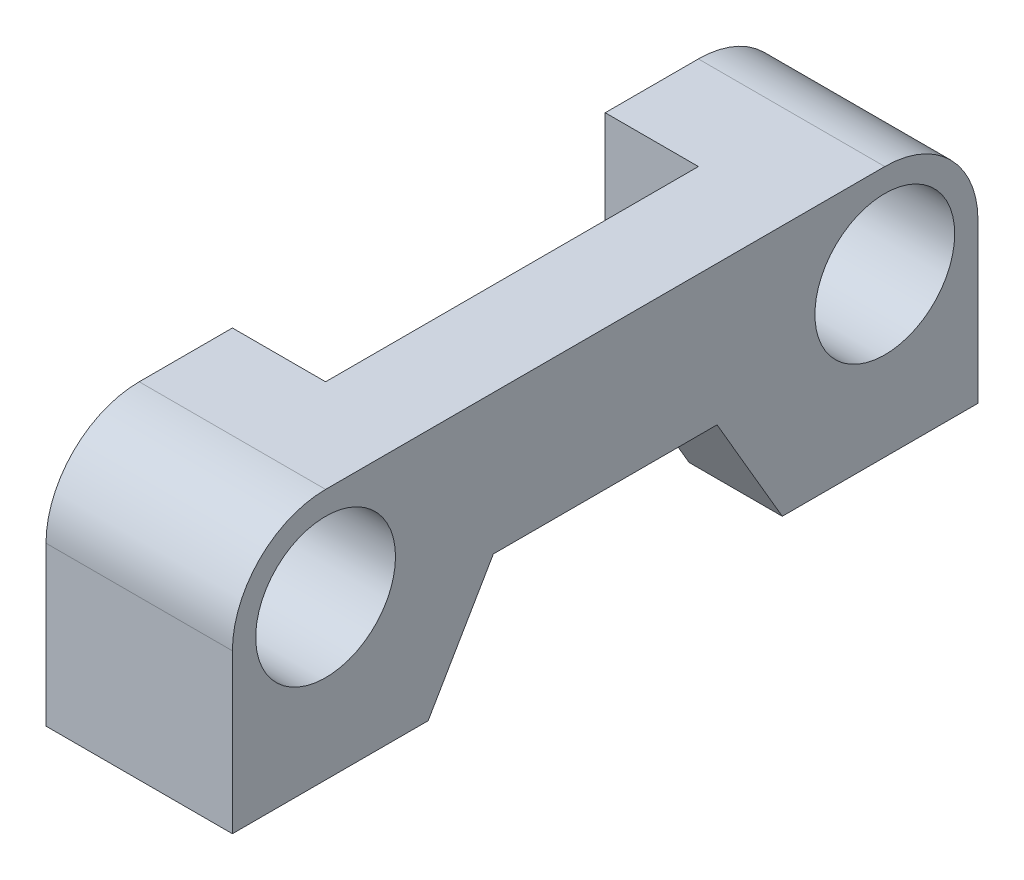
ISO-10303-21;
HEADER;
FILE_DESCRIPTION(('STEP AP214'),'2;1');
FILE_NAME('part.step','',(''),(''),'','','');
FILE_SCHEMA(('AUTOMOTIVE_DESIGN { 1 0 10303 214 1 1 1 1 }'));
ENDSEC;
DATA;
#1=APPLICATION_CONTEXT('core data for automotive mechanical design processes');
#2=APPLICATION_PROTOCOL_DEFINITION('international standard','automotive_design',2000,#1);
#3=PRODUCT_CONTEXT('',#1,'mechanical');
#4=PRODUCT('Part','Part','',(#3));
#5=PRODUCT_RELATED_PRODUCT_CATEGORY('part','',(#4));
#6=PRODUCT_DEFINITION_FORMATION('','',#4);
#7=PRODUCT_DEFINITION_CONTEXT('part definition',#1,'design');
#8=PRODUCT_DEFINITION('design','',#6,#7);
#9=PRODUCT_DEFINITION_SHAPE('','',#8);
#10=(LENGTH_UNIT() NAMED_UNIT(*) SI_UNIT(.MILLI.,.METRE.));
#11=(NAMED_UNIT(*) PLANE_ANGLE_UNIT() SI_UNIT($,.RADIAN.));
#12=(NAMED_UNIT(*) SI_UNIT($,.STERADIAN.) SOLID_ANGLE_UNIT());
#13=UNCERTAINTY_MEASURE_WITH_UNIT(LENGTH_MEASURE(1.E-05),#10,'distance_accuracy_value','');
#14=(GEOMETRIC_REPRESENTATION_CONTEXT(3) GLOBAL_UNCERTAINTY_ASSIGNED_CONTEXT((#13)) GLOBAL_UNIT_ASSIGNED_CONTEXT((#10,
#11,#12)) REPRESENTATION_CONTEXT('',''));
#15=CARTESIAN_POINT('',(0.,0.,0.));
#16=DIRECTION('',(0.,0.,1.));
#17=DIRECTION('',(1.,0.,0.));
#18=AXIS2_PLACEMENT_3D('',#15,#16,#17);
#19=CARTESIAN_POINT('',(0.,3.5,-30.));
#20=DIRECTION('',(1.,0.,0.));
#21=DIRECTION('',(0.,0.,-1.));
#22=AXIS2_PLACEMENT_3D('',#19,#20,#21);
#23=PLANE('',#22);
#24=CARTESIAN_POINT('',(0.,3.5,-30.));
#25=DIRECTION('',(1.,0.,0.));
#26=DIRECTION('',(0.,0.,-1.));
#27=AXIS2_PLACEMENT_3D('',#24,#25,#26);
#28=CIRCLE('',#27,7.5);
#29=CARTESIAN_POINT('',(0.,3.5,-37.5));
#30=VERTEX_POINT('',#29);
#31=EDGE_CURVE('E239',#30,#30,#28,.T.);
#32=ORIENTED_EDGE('',*,*,#31,.T.);
#33=EDGE_LOOP('',(#32));
#34=FACE_BOUND('',#33,.T.);
#35=DIRECTION('',(0.,0.,-1.));
#36=VECTOR('',#35,1.);
#37=CARTESIAN_POINT('',(0.,-13.5,-40.));
#38=LINE('',#37,#36);
#39=CARTESIAN_POINT('',(0.,-13.5,-20.));
#40=VERTEX_POINT('',#39);
#41=CARTESIAN_POINT('',(0.,-13.5,-40.));
#42=VERTEX_POINT('',#41);
#43=EDGE_CURVE('E91',#40,#42,#38,.T.);
#44=ORIENTED_EDGE('',*,*,#43,.F.);
#45=DIRECTION('',(0.,1.,0.));
#46=VECTOR('',#45,1.);
#47=CARTESIAN_POINT('',(0.,-13.5,-20.));
#48=LINE('',#47,#46);
#49=CARTESIAN_POINT('',(0.,13.5,-20.));
#50=VERTEX_POINT('',#49);
#51=EDGE_CURVE('E204',#40,#50,#48,.T.);
#52=ORIENTED_EDGE('',*,*,#51,.T.);
#53=DIRECTION('',(0.,0.,1.));
#54=VECTOR('',#53,1.);
#55=CARTESIAN_POINT('',(0.,13.5,-29.9999999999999));
#56=LINE('',#55,#54);
#57=CARTESIAN_POINT('',(0.,13.5,-29.9999999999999));
#58=VERTEX_POINT('',#57);
#59=EDGE_CURVE('E163',#58,#50,#56,.T.);
#60=ORIENTED_EDGE('',*,*,#59,.F.);
#61=CARTESIAN_POINT('',(0.,3.5,-30.));
#62=DIRECTION('',(1.,0.,0.));
#63=DIRECTION('',(0.,0.,-1.));
#64=AXIS2_PLACEMENT_3D('',#61,#62,#63);
#65=CIRCLE('',#64,10.);
#66=CARTESIAN_POINT('',(0.,3.49999999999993,-40.));
#67=VERTEX_POINT('',#66);
#68=EDGE_CURVE('E158',#67,#58,#65,.T.);
#69=ORIENTED_EDGE('',*,*,#68,.F.);
#70=DIRECTION('',(0.,1.,0.));
#71=VECTOR('',#70,1.);
#72=CARTESIAN_POINT('',(0.,-13.5,-40.));
#73=LINE('',#72,#71);
#74=EDGE_CURVE('E154',#42,#67,#73,.T.);
#75=ORIENTED_EDGE('',*,*,#74,.F.);
#76=EDGE_LOOP('',(#44,#52,#60,#69,#75));
#77=FACE_BOUND('',#76,.T.);
#78=ADVANCED_FACE('F40',(#34,#77),#23,.F.);
#79=CARTESIAN_POINT('',(20.,3.5,-30.));
#80=DIRECTION('',(1.,0.,0.));
#81=DIRECTION('',(0.,0.,-1.));
#82=AXIS2_PLACEMENT_3D('',#79,#80,#81);
#83=PLANE('',#82);
#84=CARTESIAN_POINT('',(20.,3.5,30.));
#85=DIRECTION('',(1.,0.,0.));
#86=DIRECTION('',(0.,0.,-1.));
#87=AXIS2_PLACEMENT_3D('',#84,#85,#86);
#88=CIRCLE('',#87,7.5);
#89=CARTESIAN_POINT('',(20.,3.5,22.5));
#90=VERTEX_POINT('',#89);
#91=EDGE_CURVE('E159',#90,#90,#88,.T.);
#92=ORIENTED_EDGE('',*,*,#91,.F.);
#93=EDGE_LOOP('',(#92));
#94=FACE_BOUND('',#93,.T.);
#95=DIRECTION('',(0.,1.,0.));
#96=VECTOR('',#95,1.);
#97=CARTESIAN_POINT('',(20.,-13.5,-40.));
#98=LINE('',#97,#96);
#99=CARTESIAN_POINT('',(20.,-13.5,-40.));
#100=VERTEX_POINT('',#99);
#101=CARTESIAN_POINT('',(20.,3.49999999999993,-40.));
#102=VERTEX_POINT('',#101);
#103=EDGE_CURVE('E174',#100,#102,#98,.T.);
#104=ORIENTED_EDGE('',*,*,#103,.T.);
#105=CARTESIAN_POINT('',(20.,3.5,-30.));
#106=DIRECTION('',(1.,0.,0.));
#107=DIRECTION('',(0.,0.,-1.));
#108=AXIS2_PLACEMENT_3D('',#105,#106,#107);
#109=CIRCLE('',#108,10.);
#110=CARTESIAN_POINT('',(20.,13.5,-29.9999999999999));
#111=VERTEX_POINT('',#110);
#112=EDGE_CURVE('E101',#102,#111,#109,.T.);
#113=ORIENTED_EDGE('',*,*,#112,.T.);
#114=DIRECTION('',(0.,0.,1.));
#115=VECTOR('',#114,1.);
#116=CARTESIAN_POINT('',(20.,13.5,-29.9999999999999));
#117=LINE('',#116,#115);
#118=CARTESIAN_POINT('',(20.,13.5,30.));
#119=VERTEX_POINT('',#118);
#120=EDGE_CURVE('E258',#111,#119,#117,.T.);
#121=ORIENTED_EDGE('',*,*,#120,.T.);
#122=CARTESIAN_POINT('',(20.,3.5,30.));
#123=DIRECTION('',(1.,0.,0.));
#124=DIRECTION('',(0.,0.,-1.));
#125=AXIS2_PLACEMENT_3D('',#122,#123,#124);
#126=CIRCLE('',#125,10.);
#127=CARTESIAN_POINT('',(20.,3.49999999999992,40.));
#128=VERTEX_POINT('',#127);
#129=EDGE_CURVE('E260',#119,#128,#126,.T.);
#130=ORIENTED_EDGE('',*,*,#129,.T.);
#131=DIRECTION('',(0.,-1.,0.));
#132=VECTOR('',#131,1.);
#133=CARTESIAN_POINT('',(20.,-13.5,40.));
#134=LINE('',#133,#132);
#135=CARTESIAN_POINT('',(20.,-13.5,40.));
#136=VERTEX_POINT('',#135);
#137=EDGE_CURVE('E262',#128,#136,#134,.T.);
#138=ORIENTED_EDGE('',*,*,#137,.T.);
#139=DIRECTION('',(0.,0.,-1.));
#140=VECTOR('',#139,1.);
#141=CARTESIAN_POINT('',(20.,-13.5,19.));
#142=LINE('',#141,#140);
#143=CARTESIAN_POINT('',(20.,-13.5,19.));
#144=VERTEX_POINT('',#143);
#145=EDGE_CURVE('E264',#136,#144,#142,.T.);
#146=ORIENTED_EDGE('',*,*,#145,.T.);
#147=DIRECTION('',(0.,0.863778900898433,-0.503871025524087));
#148=VECTOR('',#147,1.);
#149=CARTESIAN_POINT('',(20.,-13.5,19.));
#150=LINE('',#149,#148);
#151=CARTESIAN_POINT('',(20.,-1.5,12.));
#152=VERTEX_POINT('',#151);
#153=EDGE_CURVE('E130',#144,#152,#150,.T.);
#154=ORIENTED_EDGE('',*,*,#153,.T.);
#155=DIRECTION('',(0.,0.,-1.));
#156=VECTOR('',#155,1.);
#157=CARTESIAN_POINT('',(20.,-1.5,12.));
#158=LINE('',#157,#156);
#159=CARTESIAN_POINT('',(20.,-1.5,-12.));
#160=VERTEX_POINT('',#159);
#161=EDGE_CURVE('E122',#152,#160,#158,.T.);
#162=ORIENTED_EDGE('',*,*,#161,.T.);
#163=DIRECTION('',(0.,-0.863778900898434,-0.503871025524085));
#164=VECTOR('',#163,1.);
#165=CARTESIAN_POINT('',(20.,-1.5,-12.));
#166=LINE('',#165,#164);
#167=CARTESIAN_POINT('',(20.,-13.5,-19.));
#168=VERTEX_POINT('',#167);
#169=EDGE_CURVE('E127',#160,#168,#166,.T.);
#170=ORIENTED_EDGE('',*,*,#169,.T.);
#171=DIRECTION('',(0.,0.,-1.));
#172=VECTOR('',#171,1.);
#173=CARTESIAN_POINT('',(20.,-13.5,-40.));
#174=LINE('',#173,#172);
#175=EDGE_CURVE('E64',#168,#100,#174,.T.);
#176=ORIENTED_EDGE('',*,*,#175,.T.);
#177=EDGE_LOOP('',(#104,#113,#121,#130,#138,#146,#154,#162,#170,#176));
#178=FACE_BOUND('',#177,.T.);
#179=CARTESIAN_POINT('',(20.,3.5,-30.));
#180=DIRECTION('',(1.,0.,0.));
#181=DIRECTION('',(0.,0.,-1.));
#182=AXIS2_PLACEMENT_3D('',#179,#180,#181);
#183=CIRCLE('',#182,7.5);
#184=CARTESIAN_POINT('',(20.,3.5,-37.5));
#185=VERTEX_POINT('',#184);
#186=EDGE_CURVE('E242',#185,#185,#183,.T.);
#187=ORIENTED_EDGE('',*,*,#186,.F.);
#188=EDGE_LOOP('',(#187));
#189=FACE_BOUND('',#188,.T.);
#190=ADVANCED_FACE('F124',(#94,#178,#189),#83,.T.);
#191=CARTESIAN_POINT('',(0.,3.5,30.));
#192=DIRECTION('',(1.,0.,0.));
#193=DIRECTION('',(0.,0.,-1.));
#194=AXIS2_PLACEMENT_3D('',#191,#192,#193);
#195=CIRCLE('',#194,7.5);
#196=CARTESIAN_POINT('',(0.,3.5,22.5));
#197=VERTEX_POINT('',#196);
#198=EDGE_CURVE('E248',#197,#197,#195,.T.);
#199=ORIENTED_EDGE('',*,*,#198,.T.);
#200=EDGE_LOOP('',(#199));
#201=FACE_BOUND('',#200,.T.);
#202=CARTESIAN_POINT('',(0.,13.5,20.));
#203=VERTEX_POINT('',#202);
#204=CARTESIAN_POINT('',(0.,13.5,30.));
#205=VERTEX_POINT('',#204);
#206=EDGE_CURVE('E162',#203,#205,#56,.T.);
#207=ORIENTED_EDGE('',*,*,#206,.F.);
#208=DIRECTION('',(0.,1.,0.));
#209=VECTOR('',#208,1.);
#210=CARTESIAN_POINT('',(0.,-13.5,20.));
#211=LINE('',#210,#209);
#212=CARTESIAN_POINT('',(0.,-13.5,20.));
#213=VERTEX_POINT('',#212);
#214=EDGE_CURVE('E275',#213,#203,#211,.T.);
#215=ORIENTED_EDGE('',*,*,#214,.F.);
#216=DIRECTION('',(0.,0.,-1.));
#217=VECTOR('',#216,1.);
#218=CARTESIAN_POINT('',(0.,-13.5,19.));
#219=LINE('',#218,#217);
#220=CARTESIAN_POINT('',(0.,-13.5,40.));
#221=VERTEX_POINT('',#220);
#222=EDGE_CURVE('E170',#221,#213,#219,.T.);
#223=ORIENTED_EDGE('',*,*,#222,.F.);
#224=DIRECTION('',(0.,-1.,0.));
#225=VECTOR('',#224,1.);
#226=CARTESIAN_POINT('',(0.,-13.5,40.));
#227=LINE('',#226,#225);
#228=CARTESIAN_POINT('',(0.,3.49999999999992,40.));
#229=VERTEX_POINT('',#228);
#230=EDGE_CURVE('E168',#229,#221,#227,.T.);
#231=ORIENTED_EDGE('',*,*,#230,.F.);
#232=CARTESIAN_POINT('',(0.,3.5,30.));
#233=DIRECTION('',(1.,0.,0.));
#234=DIRECTION('',(0.,0.,-1.));
#235=AXIS2_PLACEMENT_3D('',#232,#233,#234);
#236=CIRCLE('',#235,10.);
#237=EDGE_CURVE('E166',#205,#229,#236,.T.);
#238=ORIENTED_EDGE('',*,*,#237,.F.);
#239=EDGE_LOOP('',(#207,#215,#223,#231,#238));
#240=FACE_BOUND('',#239,.T.);
#241=ADVANCED_FACE('F307',(#201,#240),#23,.F.);
#242=CARTESIAN_POINT('',(20.,-13.5,-40.));
#243=DIRECTION('',(0.,0.,1.));
#244=DIRECTION('',(1.,0.,0.));
#245=AXIS2_PLACEMENT_3D('',#242,#243,#244);
#246=PLANE('',#245);
#247=ORIENTED_EDGE('',*,*,#74,.T.);
#248=DIRECTION('',(-1.,0.,0.));
#249=VECTOR('',#248,1.);
#250=CARTESIAN_POINT('',(20.,3.49999999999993,-40.));
#251=LINE('',#250,#249);
#252=EDGE_CURVE('E48',#102,#67,#251,.T.);
#253=ORIENTED_EDGE('',*,*,#252,.F.);
#254=ORIENTED_EDGE('',*,*,#103,.F.);
#255=DIRECTION('',(-1.,0.,0.));
#256=VECTOR('',#255,1.);
#257=CARTESIAN_POINT('',(20.,-13.5,-40.));
#258=LINE('',#257,#256);
#259=EDGE_CURVE('E150',#100,#42,#258,.T.);
#260=ORIENTED_EDGE('',*,*,#259,.T.);
#261=EDGE_LOOP('',(#247,#253,#254,#260));
#262=FACE_BOUND('',#261,.T.);
#263=ADVANCED_FACE('F42',(#262),#246,.F.);
#264=CARTESIAN_POINT('',(20.,3.5,-30.));
#265=DIRECTION('',(-1.,0.,0.));
#266=DIRECTION('',(0.,0.,1.));
#267=AXIS2_PLACEMENT_3D('',#264,#265,#266);
#268=CYLINDRICAL_SURFACE('',#267,10.);
#269=ORIENTED_EDGE('',*,*,#68,.T.);
#270=DIRECTION('',(-1.,0.,0.));
#271=VECTOR('',#270,1.);
#272=CARTESIAN_POINT('',(20.,13.5,-29.9999999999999));
#273=LINE('',#272,#271);
#274=EDGE_CURVE('E190',#111,#58,#273,.T.);
#275=ORIENTED_EDGE('',*,*,#274,.F.);
#276=ORIENTED_EDGE('',*,*,#112,.F.);
#277=ORIENTED_EDGE('',*,*,#252,.T.);
#278=EDGE_LOOP('',(#269,#275,#276,#277));
#279=FACE_BOUND('',#278,.T.);
#280=ADVANCED_FACE('F195',(#279),#268,.T.);
#281=CARTESIAN_POINT('',(20.,13.5,-29.9999999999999));
#282=DIRECTION('',(0.,-1.,0.));
#283=DIRECTION('',(0.,0.,-1.));
#284=AXIS2_PLACEMENT_3D('',#281,#282,#283);
#285=PLANE('',#284);
#286=ORIENTED_EDGE('',*,*,#59,.T.);
#287=DIRECTION('',(-1.,0.,0.));
#288=VECTOR('',#287,1.);
#289=CARTESIAN_POINT('',(0.,13.5,-20.));
#290=LINE('',#289,#288);
#291=CARTESIAN_POINT('',(10.,13.5,-20.));
#292=VERTEX_POINT('',#291);
#293=EDGE_CURVE('E211',#292,#50,#290,.T.);
#294=ORIENTED_EDGE('',*,*,#293,.F.);
#295=DIRECTION('',(0.,0.,-1.));
#296=VECTOR('',#295,1.);
#297=CARTESIAN_POINT('',(10.,13.5,-20.));
#298=LINE('',#297,#296);
#299=CARTESIAN_POINT('',(10.,13.5,20.));
#300=VERTEX_POINT('',#299);
#301=EDGE_CURVE('E282',#300,#292,#298,.T.);
#302=ORIENTED_EDGE('',*,*,#301,.F.);
#303=DIRECTION('',(1.,0.,0.));
#304=VECTOR('',#303,1.);
#305=CARTESIAN_POINT('',(0.,13.5,20.));
#306=LINE('',#305,#304);
#307=EDGE_CURVE('E279',#203,#300,#306,.T.);
#308=ORIENTED_EDGE('',*,*,#307,.F.);
#309=ORIENTED_EDGE('',*,*,#206,.T.);
#310=DIRECTION('',(-1.,0.,0.));
#311=VECTOR('',#310,1.);
#312=CARTESIAN_POINT('',(20.,13.5,30.));
#313=LINE('',#312,#311);
#314=EDGE_CURVE('E187',#119,#205,#313,.T.);
#315=ORIENTED_EDGE('',*,*,#314,.F.);
#316=ORIENTED_EDGE('',*,*,#120,.F.);
#317=ORIENTED_EDGE('',*,*,#274,.T.);
#318=EDGE_LOOP('',(#286,#294,#302,#308,#309,#315,#316,#317));
#319=FACE_BOUND('',#318,.T.);
#320=ADVANCED_FACE('F207',(#319),#285,.F.);
#321=CARTESIAN_POINT('',(20.,3.5,30.));
#322=DIRECTION('',(-1.,0.,0.));
#323=DIRECTION('',(0.,0.,1.));
#324=AXIS2_PLACEMENT_3D('',#321,#322,#323);
#325=CYLINDRICAL_SURFACE('',#324,10.);
#326=ORIENTED_EDGE('',*,*,#237,.T.);
#327=DIRECTION('',(-1.,0.,0.));
#328=VECTOR('',#327,1.);
#329=CARTESIAN_POINT('',(20.,3.49999999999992,40.));
#330=LINE('',#329,#328);
#331=EDGE_CURVE('E184',#128,#229,#330,.T.);
#332=ORIENTED_EDGE('',*,*,#331,.F.);
#333=ORIENTED_EDGE('',*,*,#129,.F.);
#334=ORIENTED_EDGE('',*,*,#314,.T.);
#335=EDGE_LOOP('',(#326,#332,#333,#334));
#336=FACE_BOUND('',#335,.T.);
#337=ADVANCED_FACE('F300',(#336),#325,.T.);
#338=CARTESIAN_POINT('',(20.,-13.5,40.));
#339=DIRECTION('',(0.,0.,-1.));
#340=DIRECTION('',(-1.,0.,0.));
#341=AXIS2_PLACEMENT_3D('',#338,#339,#340);
#342=PLANE('',#341);
#343=ORIENTED_EDGE('',*,*,#230,.T.);
#344=DIRECTION('',(-1.,0.,0.));
#345=VECTOR('',#344,1.);
#346=CARTESIAN_POINT('',(20.,-13.5,40.));
#347=LINE('',#346,#345);
#348=EDGE_CURVE('E181',#136,#221,#347,.T.);
#349=ORIENTED_EDGE('',*,*,#348,.F.);
#350=ORIENTED_EDGE('',*,*,#137,.F.);
#351=ORIENTED_EDGE('',*,*,#331,.T.);
#352=EDGE_LOOP('',(#343,#349,#350,#351));
#353=FACE_BOUND('',#352,.T.);
#354=ADVANCED_FACE('F303',(#353),#342,.F.);
#355=CARTESIAN_POINT('',(20.,-13.5,19.));
#356=DIRECTION('',(0.,1.,0.));
#357=DIRECTION('',(0.,0.,1.));
#358=AXIS2_PLACEMENT_3D('',#355,#356,#357);
#359=PLANE('',#358);
#360=DIRECTION('',(1.,0.,0.));
#361=VECTOR('',#360,1.);
#362=CARTESIAN_POINT('',(0.,-13.5,20.));
#363=LINE('',#362,#361);
#364=CARTESIAN_POINT('',(10.,-13.5,20.));
#365=VERTEX_POINT('',#364);
#366=EDGE_CURVE('E272',#213,#365,#363,.T.);
#367=ORIENTED_EDGE('',*,*,#366,.T.);
#368=DIRECTION('',(0.,0.,-1.));
#369=VECTOR('',#368,1.);
#370=CARTESIAN_POINT('',(10.,-13.5,-20.));
#371=LINE('',#370,#369);
#372=CARTESIAN_POINT('',(10.,-13.5,19.));
#373=VERTEX_POINT('',#372);
#374=EDGE_CURVE('E271',#365,#373,#371,.T.);
#375=ORIENTED_EDGE('',*,*,#374,.T.);
#376=DIRECTION('',(-1.,0.,0.));
#377=VECTOR('',#376,1.);
#378=CARTESIAN_POINT('',(20.,-13.5,19.));
#379=LINE('',#378,#377);
#380=EDGE_CURVE('E178',#144,#373,#379,.T.);
#381=ORIENTED_EDGE('',*,*,#380,.F.);
#382=ORIENTED_EDGE('',*,*,#145,.F.);
#383=ORIENTED_EDGE('',*,*,#348,.T.);
#384=ORIENTED_EDGE('',*,*,#222,.T.);
#385=EDGE_LOOP('',(#367,#375,#381,#382,#383,#384));
#386=FACE_BOUND('',#385,.T.);
#387=ADVANCED_FACE('F270',(#386),#359,.F.);
#388=CARTESIAN_POINT('',(20.,-13.5,19.));
#389=DIRECTION('',(0.,0.503871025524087,0.863778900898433));
#390=DIRECTION('',(0.,-0.863778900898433,0.503871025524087));
#391=AXIS2_PLACEMENT_3D('',#388,#389,#390);
#392=PLANE('',#391);
#393=ORIENTED_EDGE('',*,*,#380,.T.);
#394=DIRECTION('',(0.,0.863778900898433,-0.503871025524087));
#395=VECTOR('',#394,1.);
#396=CARTESIAN_POINT('',(10.,-13.5,19.));
#397=LINE('',#396,#395);
#398=CARTESIAN_POINT('',(10.,-1.5,12.));
#399=VERTEX_POINT('',#398);
#400=EDGE_CURVE('E233',#373,#399,#397,.T.);
#401=ORIENTED_EDGE('',*,*,#400,.T.);
#402=DIRECTION('',(-1.,0.,0.));
#403=VECTOR('',#402,1.);
#404=CARTESIAN_POINT('',(20.,-1.5,12.));
#405=LINE('',#404,#403);
#406=EDGE_CURVE('E144',#152,#399,#405,.T.);
#407=ORIENTED_EDGE('',*,*,#406,.F.);
#408=ORIENTED_EDGE('',*,*,#153,.F.);
#409=EDGE_LOOP('',(#393,#401,#407,#408));
#410=FACE_BOUND('',#409,.T.);
#411=ADVANCED_FACE('F237',(#410),#392,.F.);
#412=CARTESIAN_POINT('',(20.,-1.5,12.));
#413=DIRECTION('',(0.,1.,0.));
#414=DIRECTION('',(0.,0.,1.));
#415=AXIS2_PLACEMENT_3D('',#412,#413,#414);
#416=PLANE('',#415);
#417=ORIENTED_EDGE('',*,*,#406,.T.);
#418=DIRECTION('',(0.,0.,-1.));
#419=VECTOR('',#418,1.);
#420=CARTESIAN_POINT('',(10.,-1.5,12.));
#421=LINE('',#420,#419);
#422=CARTESIAN_POINT('',(10.,-1.5,-12.));
#423=VERTEX_POINT('',#422);
#424=EDGE_CURVE('E141',#399,#423,#421,.T.);
#425=ORIENTED_EDGE('',*,*,#424,.T.);
#426=DIRECTION('',(-1.,0.,0.));
#427=VECTOR('',#426,1.);
#428=CARTESIAN_POINT('',(20.,-1.5,-12.));
#429=LINE('',#428,#427);
#430=EDGE_CURVE('E137',#160,#423,#429,.T.);
#431=ORIENTED_EDGE('',*,*,#430,.F.);
#432=ORIENTED_EDGE('',*,*,#161,.F.);
#433=EDGE_LOOP('',(#417,#425,#431,#432));
#434=FACE_BOUND('',#433,.T.);
#435=ADVANCED_FACE('F138',(#434),#416,.F.);
#436=CARTESIAN_POINT('',(20.,-1.5,-12.));
#437=DIRECTION('',(0.,0.503871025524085,-0.863778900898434));
#438=DIRECTION('',(0.,0.863778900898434,0.503871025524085));
#439=AXIS2_PLACEMENT_3D('',#436,#437,#438);
#440=PLANE('',#439);
#441=ORIENTED_EDGE('',*,*,#430,.T.);
#442=DIRECTION('',(0.,-0.863778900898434,-0.503871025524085));
#443=VECTOR('',#442,1.);
#444=CARTESIAN_POINT('',(10.,-1.5,-12.));
#445=LINE('',#444,#443);
#446=CARTESIAN_POINT('',(10.,-13.5,-19.));
#447=VERTEX_POINT('',#446);
#448=EDGE_CURVE('E229',#423,#447,#445,.T.);
#449=ORIENTED_EDGE('',*,*,#448,.T.);
#450=DIRECTION('',(-1.,0.,0.));
#451=VECTOR('',#450,1.);
#452=CARTESIAN_POINT('',(20.,-13.5,-19.));
#453=LINE('',#452,#451);
#454=EDGE_CURVE('E145',#168,#447,#453,.T.);
#455=ORIENTED_EDGE('',*,*,#454,.F.);
#456=ORIENTED_EDGE('',*,*,#169,.F.);
#457=EDGE_LOOP('',(#441,#449,#455,#456));
#458=FACE_BOUND('',#457,.T.);
#459=ADVANCED_FACE('F147',(#458),#440,.F.);
#460=CARTESIAN_POINT('',(20.,-13.5,-40.));
#461=DIRECTION('',(0.,1.,0.));
#462=DIRECTION('',(0.,0.,1.));
#463=AXIS2_PLACEMENT_3D('',#460,#461,#462);
#464=PLANE('',#463);
#465=DIRECTION('',(0.,0.,-1.));
#466=VECTOR('',#465,1.);
#467=CARTESIAN_POINT('',(10.,-13.5,-40.));
#468=LINE('',#467,#466);
#469=CARTESIAN_POINT('',(10.,-13.5,-20.));
#470=VERTEX_POINT('',#469);
#471=EDGE_CURVE('E11',#447,#470,#468,.T.);
#472=ORIENTED_EDGE('',*,*,#471,.T.);
#473=DIRECTION('',(-1.,0.,0.));
#474=VECTOR('',#473,1.);
#475=CARTESIAN_POINT('',(0.,-13.5,-20.));
#476=LINE('',#475,#474);
#477=EDGE_CURVE('E55',#470,#40,#476,.T.);
#478=ORIENTED_EDGE('',*,*,#477,.T.);
#479=ORIENTED_EDGE('',*,*,#43,.T.);
#480=ORIENTED_EDGE('',*,*,#259,.F.);
#481=ORIENTED_EDGE('',*,*,#175,.F.);
#482=ORIENTED_EDGE('',*,*,#454,.T.);
#483=EDGE_LOOP('',(#472,#478,#479,#480,#481,#482));
#484=FACE_BOUND('',#483,.T.);
#485=ADVANCED_FACE('F292',(#484),#464,.F.);
#486=CARTESIAN_POINT('',(20.,3.5,30.));
#487=DIRECTION('',(-1.,0.,0.));
#488=DIRECTION('',(0.,0.,1.));
#489=AXIS2_PLACEMENT_3D('',#486,#487,#488);
#490=CYLINDRICAL_SURFACE('',#489,7.5);
#491=ORIENTED_EDGE('',*,*,#91,.T.);
#492=EDGE_LOOP('',(#491));
#493=FACE_BOUND('',#492,.T.);
#494=ORIENTED_EDGE('',*,*,#198,.F.);
#495=EDGE_LOOP('',(#494));
#496=FACE_BOUND('',#495,.T.);
#497=ADVANCED_FACE('F341',(#493,#496),#490,.F.);
#498=CARTESIAN_POINT('',(20.,3.5,-30.));
#499=DIRECTION('',(-1.,0.,0.));
#500=DIRECTION('',(0.,0.,1.));
#501=AXIS2_PLACEMENT_3D('',#498,#499,#500);
#502=CYLINDRICAL_SURFACE('',#501,7.5);
#503=ORIENTED_EDGE('',*,*,#186,.T.);
#504=EDGE_LOOP('',(#503));
#505=FACE_BOUND('',#504,.T.);
#506=ORIENTED_EDGE('',*,*,#31,.F.);
#507=EDGE_LOOP('',(#506));
#508=FACE_BOUND('',#507,.T.);
#509=ADVANCED_FACE('F323',(#505,#508),#502,.F.);
#510=CARTESIAN_POINT('',(10.,-13.5,-20.));
#511=DIRECTION('',(1.,0.,0.));
#512=DIRECTION('',(0.,0.,-1.));
#513=AXIS2_PLACEMENT_3D('',#510,#511,#512);
#514=PLANE('',#513);
#515=ORIENTED_EDGE('',*,*,#374,.F.);
#516=DIRECTION('',(0.,1.,0.));
#517=VECTOR('',#516,1.);
#518=CARTESIAN_POINT('',(10.,-13.5,20.));
#519=LINE('',#518,#517);
#520=EDGE_CURVE('E289',#365,#300,#519,.T.);
#521=ORIENTED_EDGE('',*,*,#520,.T.);
#522=ORIENTED_EDGE('',*,*,#301,.T.);
#523=DIRECTION('',(0.,1.,0.));
#524=VECTOR('',#523,1.);
#525=CARTESIAN_POINT('',(10.,-13.5,-20.));
#526=LINE('',#525,#524);
#527=EDGE_CURVE('E287',#470,#292,#526,.T.);
#528=ORIENTED_EDGE('',*,*,#527,.F.);
#529=ORIENTED_EDGE('',*,*,#471,.F.);
#530=ORIENTED_EDGE('',*,*,#448,.F.);
#531=ORIENTED_EDGE('',*,*,#424,.F.);
#532=ORIENTED_EDGE('',*,*,#400,.F.);
#533=EDGE_LOOP('',(#515,#521,#522,#528,#529,#530,#531,#532));
#534=FACE_BOUND('',#533,.T.);
#535=ADVANCED_FACE('F232',(#534),#514,.F.);
#536=CARTESIAN_POINT('',(0.,-13.5,-20.));
#537=DIRECTION('',(0.,0.,-1.));
#538=DIRECTION('',(-1.,0.,0.));
#539=AXIS2_PLACEMENT_3D('',#536,#537,#538);
#540=PLANE('',#539);
#541=ORIENTED_EDGE('',*,*,#293,.T.);
#542=ORIENTED_EDGE('',*,*,#51,.F.);
#543=ORIENTED_EDGE('',*,*,#477,.F.);
#544=ORIENTED_EDGE('',*,*,#527,.T.);
#545=EDGE_LOOP('',(#541,#542,#543,#544));
#546=FACE_BOUND('',#545,.T.);
#547=ADVANCED_FACE('F315',(#546),#540,.F.);
#548=CARTESIAN_POINT('',(0.,-13.5,20.));
#549=DIRECTION('',(0.,0.,1.));
#550=DIRECTION('',(0.,-1.,0.));
#551=AXIS2_PLACEMENT_3D('',#548,#549,#550);
#552=PLANE('',#551);
#553=ORIENTED_EDGE('',*,*,#307,.T.);
#554=ORIENTED_EDGE('',*,*,#520,.F.);
#555=ORIENTED_EDGE('',*,*,#366,.F.);
#556=ORIENTED_EDGE('',*,*,#214,.T.);
#557=EDGE_LOOP('',(#553,#554,#555,#556));
#558=FACE_BOUND('',#557,.T.);
#559=ADVANCED_FACE('F310',(#558),#552,.F.);
#560=CLOSED_SHELL('',(#78,#190,#241,#263,#280,#320,#337,#354,#387,#411,#435,#459,#485,#497,#509,
#535,#547,#559));
#561=MANIFOLD_SOLID_BREP('B2',#560);
#562=ADVANCED_BREP_SHAPE_REPRESENTATION('',(#18,#561),#14);
#563=SHAPE_DEFINITION_REPRESENTATION(#9,#562);
ENDSEC;
END-ISO-10303-21;
